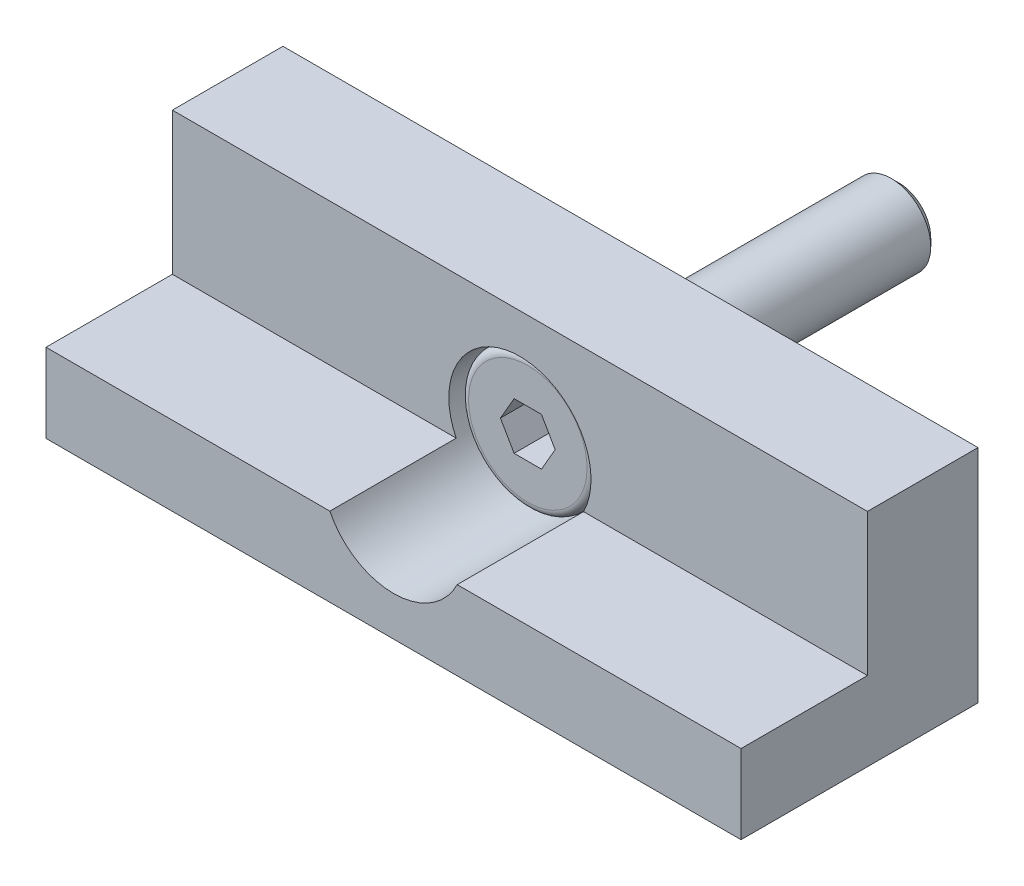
ISO-10303-21;
HEADER;
FILE_DESCRIPTION(('STEP AP214'),'2;1');
FILE_NAME('part.step','',(''),(''),'','','');
FILE_SCHEMA(('AUTOMOTIVE_DESIGN { 1 0 10303 214 1 1 1 1 }'));
ENDSEC;
DATA;
#1=APPLICATION_CONTEXT('core data for automotive mechanical design processes');
#2=APPLICATION_PROTOCOL_DEFINITION('international standard','automotive_design',2000,#1);
#3=PRODUCT_CONTEXT('',#1,'mechanical');
#4=PRODUCT('Part','Part','',(#3));
#5=PRODUCT_RELATED_PRODUCT_CATEGORY('part','',(#4));
#6=PRODUCT_DEFINITION_FORMATION('','',#4);
#7=PRODUCT_DEFINITION_CONTEXT('part definition',#1,'design');
#8=PRODUCT_DEFINITION('design','',#6,#7);
#9=PRODUCT_DEFINITION_SHAPE('','',#8);
#10=(LENGTH_UNIT() NAMED_UNIT(*) SI_UNIT(.MILLI.,.METRE.));
#11=(NAMED_UNIT(*) PLANE_ANGLE_UNIT() SI_UNIT($,.RADIAN.));
#12=(NAMED_UNIT(*) SI_UNIT($,.STERADIAN.) SOLID_ANGLE_UNIT());
#13=UNCERTAINTY_MEASURE_WITH_UNIT(LENGTH_MEASURE(1.E-05),#10,'distance_accuracy_value','');
#14=(GEOMETRIC_REPRESENTATION_CONTEXT(3) GLOBAL_UNCERTAINTY_ASSIGNED_CONTEXT((#13)) GLOBAL_UNIT_ASSIGNED_CONTEXT((#10,
#11,#12)) REPRESENTATION_CONTEXT('',''));
#15=CARTESIAN_POINT('',(0.,0.,0.));
#16=DIRECTION('',(0.,0.,1.));
#17=DIRECTION('',(1.,0.,0.));
#18=AXIS2_PLACEMENT_3D('',#15,#16,#17);
#19=CARTESIAN_POINT('',(0.,1.25,-17.));
#20=DIRECTION('',(0.,0.,-1.));
#21=DIRECTION('',(0.,1.,0.));
#22=AXIS2_PLACEMENT_3D('',#19,#20,#21);
#23=PLANE('',#22);
#24=CARTESIAN_POINT('',(0.,0.,-16.9999999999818));
#25=DIRECTION('',(0.,0.,1.));
#26=DIRECTION('',(1.,0.,0.));
#27=AXIS2_PLACEMENT_3D('',#24,#25,#26);
#28=CIRCLE('',#27,2.00924000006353);
#29=CARTESIAN_POINT('',(2.00924000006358,0.,-16.9999999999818));
#30=VERTEX_POINT('',#29);
#31=EDGE_CURVE('E273',#30,#30,#28,.T.);
#32=ORIENTED_EDGE('',*,*,#31,.F.);
#33=EDGE_LOOP('',(#32));
#34=FACE_BOUND('',#33,.T.);
#35=ADVANCED_FACE('F14',(#34),#23,.T.);
#36=CARTESIAN_POINT('',(0.,0.,-16.5092399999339));
#37=DIRECTION('',(0.,0.,1.));
#38=DIRECTION('',(1.,0.,0.));
#39=AXIS2_PLACEMENT_3D('',#36,#37,#38);
#40=CONICAL_SURFACE('',#39,2.50000000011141,0.785398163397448);
#41=ORIENTED_EDGE('',*,*,#31,.T.);
#42=EDGE_LOOP('',(#41));
#43=FACE_BOUND('',#42,.T.);
#44=CARTESIAN_POINT('',(0.,0.,-16.50924));
#45=DIRECTION('',(0.,0.,-1.));
#46=DIRECTION('',(0.,1.,0.));
#47=AXIS2_PLACEMENT_3D('',#44,#45,#46);
#48=CIRCLE('',#47,2.5);
#49=CARTESIAN_POINT('',(0.,2.5,-16.50924));
#50=VERTEX_POINT('',#49);
#51=EDGE_CURVE('E152',#50,#50,#48,.F.);
#52=ORIENTED_EDGE('',*,*,#51,.F.);
#53=EDGE_LOOP('',(#52));
#54=FACE_BOUND('',#53,.T.);
#55=ADVANCED_FACE('F175',(#43,#54),#40,.T.);
#56=CARTESIAN_POINT('',(0.,0.,-8.2));
#57=DIRECTION('',(0.,0.,-1.));
#58=DIRECTION('',(0.,1.,0.));
#59=AXIS2_PLACEMENT_3D('',#56,#57,#58);
#60=CYLINDRICAL_SURFACE('',#59,2.5);
#61=CARTESIAN_POINT('',(0.,0.,2.9));
#62=DIRECTION('',(0.,0.,-1.));
#63=DIRECTION('',(0.,1.,0.));
#64=AXIS2_PLACEMENT_3D('',#61,#62,#63);
#65=CIRCLE('',#64,2.5);
#66=CARTESIAN_POINT('',(0.,2.5,2.9));
#67=VERTEX_POINT('',#66);
#68=EDGE_CURVE('E22',#67,#67,#65,.T.);
#69=ORIENTED_EDGE('',*,*,#68,.T.);
#70=EDGE_LOOP('',(#69));
#71=FACE_BOUND('',#70,.T.);
#72=ORIENTED_EDGE('',*,*,#51,.T.);
#73=EDGE_LOOP('',(#72));
#74=FACE_BOUND('',#73,.T.);
#75=ADVANCED_FACE('F171',(#71,#74),#60,.T.);
#76=CARTESIAN_POINT('',(0.,0.,2.9));
#77=DIRECTION('',(0.,0.,-1.));
#78=DIRECTION('',(-1.,0.,0.));
#79=AXIS2_PLACEMENT_3D('',#76,#77,#78);
#80=TOROIDAL_SURFACE('',#79,2.6,0.1);
#81=ORIENTED_EDGE('',*,*,#68,.F.);
#82=EDGE_LOOP('',(#81));
#83=FACE_BOUND('',#82,.T.);
#84=CARTESIAN_POINT('',(0.,0.,3.));
#85=DIRECTION('',(0.,0.,-1.));
#86=DIRECTION('',(0.703656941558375,-0.710539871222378,0.));
#87=AXIS2_PLACEMENT_3D('',#84,#85,#86);
#88=CIRCLE('',#87,2.6);
#89=CARTESIAN_POINT('',(1.82950804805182,-1.84740366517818,3.));
#90=VERTEX_POINT('',#89);
#91=EDGE_CURVE('E157',#90,#90,#88,.F.);
#92=ORIENTED_EDGE('',*,*,#91,.F.);
#93=EDGE_LOOP('',(#92));
#94=FACE_BOUND('',#93,.T.);
#95=ADVANCED_FACE('F165',(#83,#94),#80,.F.);
#96=CARTESIAN_POINT('',(0.86602540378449,-1.5,6.5));
#97=DIRECTION('',(0.866025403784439,-0.5,0.));
#98=DIRECTION('',(-0.5,-0.866025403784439,0.));
#99=AXIS2_PLACEMENT_3D('',#96,#97,#98);
#100=PLANE('',#99);
#101=DIRECTION('',(0.,0.,-1.));
#102=VECTOR('',#101,1.);
#103=CARTESIAN_POINT('',(0.86602540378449,-1.5,6.5));
#104=LINE('',#103,#102);
#105=CARTESIAN_POINT('',(0.866025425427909,-1.49999996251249,3.79999998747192));
#106=VERTEX_POINT('',#105);
#107=CARTESIAN_POINT('',(0.86602540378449,-1.5,6.5));
#108=VERTEX_POINT('',#107);
#109=EDGE_CURVE('E256',#106,#108,#104,.F.);
#110=ORIENTED_EDGE('',*,*,#109,.T.);
#111=DIRECTION('',(-0.5,-0.866025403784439,0.));
#112=VECTOR('',#111,1.);
#113=CARTESIAN_POINT('',(0.86602540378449,-1.5,6.5));
#114=LINE('',#113,#112);
#115=CARTESIAN_POINT('',(1.73205080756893,0.,6.5));
#116=VERTEX_POINT('',#115);
#117=EDGE_CURVE('E260',#116,#108,#114,.T.);
#118=ORIENTED_EDGE('',*,*,#117,.F.);
#119=DIRECTION('',(0.,0.,-1.));
#120=VECTOR('',#119,1.);
#121=CARTESIAN_POINT('',(1.73205080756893,0.,6.5));
#122=LINE('',#121,#120);
#123=CARTESIAN_POINT('',(1.73205080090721,1.15384347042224E-08,3.79999999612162));
#124=VERTEX_POINT('',#123);
#125=EDGE_CURVE('E246',#116,#124,#122,.T.);
#126=ORIENTED_EDGE('',*,*,#125,.T.);
#127=CARTESIAN_POINT('',(1.73205079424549,-2.30768650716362E-08,3.79999999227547));
#128=CARTESIAN_POINT('',(1.69399422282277,-0.0659159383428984,3.77802165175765));
#129=CARTESIAN_POINT('',(1.65560914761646,-0.132400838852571,3.75803350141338));
#130=CARTESIAN_POINT('',(1.57817438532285,-0.266521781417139,3.72314478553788));
#131=CARTESIAN_POINT('',(1.53912332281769,-0.334160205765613,3.70825656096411));
#132=CARTESIAN_POINT('',(1.46150513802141,-0.468598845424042,3.68508196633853));
#133=CARTESIAN_POINT('',(1.42294995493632,-0.535378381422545,3.67664133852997));
#134=CARTESIAN_POINT('',(1.34565826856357,-0.669251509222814,3.66656687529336));
#135=CARTESIAN_POINT('',(1.30692204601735,-0.736344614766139,3.66492469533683));
#136=CARTESIAN_POINT('',(1.23454757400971,-0.861700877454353,3.66834971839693));
#137=CARTESIAN_POINT('',(1.20089846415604,-0.919982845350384,3.67257596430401));
#138=CARTESIAN_POINT('',(1.13381945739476,-1.03616709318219,3.68596797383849));
#139=CARTESIAN_POINT('',(1.10038979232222,-1.09406897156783,3.69513830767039));
#140=CARTESIAN_POINT('',(1.03317259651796,-1.21049256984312,3.71806236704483));
#141=CARTESIAN_POINT('',(0.999393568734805,-1.26899956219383,3.73191322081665));
#142=CARTESIAN_POINT('',(0.9323391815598,-1.38514116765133,3.76334880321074));
#143=CARTESIAN_POINT('',(0.899062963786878,-1.44277726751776,3.78092615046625));
#144=CARTESIAN_POINT('',(0.866025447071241,-1.49999992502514,3.79999997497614));
#145=B_SPLINE_CURVE_WITH_KNOTS('',3,(#127,#128,#129,#130,#131,#132,#133,#134,#135,#136,#137,
#138,#139,#140,#141,#142,#143,#144),.UNSPECIFIED.,.F.,.F.,(4,2,2,2,2,2,2,2,4),(0.,
0.237762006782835,0.476095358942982,0.708530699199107,0.940680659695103,1.14278080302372,
1.34506808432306,1.5518411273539,1.75820836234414),.UNSPECIFIED.);
#146=EDGE_CURVE('E230',#124,#106,#145,.T.);
#147=ORIENTED_EDGE('',*,*,#146,.T.);
#148=EDGE_LOOP('',(#110,#118,#126,#147));
#149=FACE_BOUND('',#148,.T.);
#150=ADVANCED_FACE('F170',(#149),#100,.F.);
#151=CARTESIAN_POINT('',(-0.866025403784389,-1.5,6.5));
#152=DIRECTION('',(0.,-1.,0.));
#153=DIRECTION('',(-1.,0.,0.));
#154=AXIS2_PLACEMENT_3D('',#151,#152,#153);
#155=PLANE('',#154);
#156=DIRECTION('',(0.,0.,-1.));
#157=VECTOR('',#156,1.);
#158=CARTESIAN_POINT('',(-0.866025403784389,-1.5,6.5));
#159=LINE('',#158,#157);
#160=CARTESIAN_POINT('',(-0.86602536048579,-1.5,3.79999998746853));
#161=VERTEX_POINT('',#160);
#162=CARTESIAN_POINT('',(-0.866025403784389,-1.5,6.5));
#163=VERTEX_POINT('',#162);
#164=EDGE_CURVE('E243',#161,#163,#159,.F.);
#165=ORIENTED_EDGE('',*,*,#164,.T.);
#166=DIRECTION('',(-1.,0.,0.));
#167=VECTOR('',#166,1.);
#168=CARTESIAN_POINT('',(-0.866025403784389,-1.5,6.5));
#169=LINE('',#168,#167);
#170=EDGE_CURVE('E259',#108,#163,#169,.T.);
#171=ORIENTED_EDGE('',*,*,#170,.F.);
#172=ORIENTED_EDGE('',*,*,#109,.F.);
#173=CARTESIAN_POINT('',(0.866025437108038,-1.5,3.80000000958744));
#174=CARTESIAN_POINT('',(0.789912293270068,-1.5,3.77802166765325));
#175=CARTESIAN_POINT('',(0.713142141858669,-1.5,3.75803351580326));
#176=CARTESIAN_POINT('',(0.558272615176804,-1.5,3.72314479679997));
#177=CARTESIAN_POINT('',(0.480170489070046,-1.5,3.70825657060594));
#178=CARTESIAN_POINT('',(0.324934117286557,-1.5,3.68508197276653));
#179=CARTESIAN_POINT('',(0.24782375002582,-1.5,3.67664134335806));
#180=CARTESIAN_POINT('',(0.0932403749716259,-1.5,3.66656687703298));
#181=CARTESIAN_POINT('',(0.0157679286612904,-1.5,3.66492469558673));
#182=CARTESIAN_POINT('',(-0.128981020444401,-1.5,3.66834971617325));
#183=CARTESIAN_POINT('',(-0.196279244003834,-1.5,3.67257596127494));
#184=CARTESIAN_POINT('',(-0.330437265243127,-1.5,3.68596796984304));
#185=CARTESIAN_POINT('',(-0.397296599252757,-1.5,3.69513830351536));
#186=CARTESIAN_POINT('',(-0.531730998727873,-1.5,3.71806236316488));
#187=CARTESIAN_POINT('',(-0.599289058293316,-1.5,3.73191321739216));
#188=CARTESIAN_POINT('',(-0.733397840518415,-1.5,3.7633488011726));
#189=CARTESIAN_POINT('',(-0.799950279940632,-1.5,3.7809261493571));
#190=CARTESIAN_POINT('',(-0.866025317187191,-1.5,3.7999999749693));
#191=B_SPLINE_CURVE_WITH_KNOTS('',3,(#173,#174,#175,#176,#177,#178,#179,#180,#181,#182,#183,
#184,#185,#186,#187,#188,#189,#190),.UNSPECIFIED.,.F.,.F.,(4,2,2,2,2,2,2,2,4),(0.,
0.237762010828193,0.476095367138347,0.708530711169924,0.940680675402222,1.14278083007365,
1.3450681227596,1.55184117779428,1.75820842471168),.UNSPECIFIED.);
#192=EDGE_CURVE('E304',#106,#161,#191,.T.);
#193=ORIENTED_EDGE('',*,*,#192,.T.);
#194=EDGE_LOOP('',(#165,#171,#172,#193));
#195=FACE_BOUND('',#194,.T.);
#196=ADVANCED_FACE('F332',(#195),#155,.F.);
#197=CARTESIAN_POINT('',(1.73205080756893,0.,6.5));
#198=DIRECTION('',(0.866025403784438,0.5,0.));
#199=DIRECTION('',(0.5,-0.866025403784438,0.));
#200=AXIS2_PLACEMENT_3D('',#197,#198,#199);
#201=PLANE('',#200);
#202=ORIENTED_EDGE('',*,*,#125,.F.);
#203=DIRECTION('',(0.5,-0.866025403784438,0.));
#204=VECTOR('',#203,1.);
#205=CARTESIAN_POINT('',(1.73205080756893,0.,6.5));
#206=LINE('',#205,#204);
#207=CARTESIAN_POINT('',(0.86602540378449,1.5,6.5));
#208=VERTEX_POINT('',#207);
#209=EDGE_CURVE('E253',#208,#116,#206,.T.);
#210=ORIENTED_EDGE('',*,*,#209,.F.);
#211=DIRECTION('',(0.,0.,-1.));
#212=VECTOR('',#211,1.);
#213=CARTESIAN_POINT('',(0.86602540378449,1.5,6.5));
#214=LINE('',#213,#212);
#215=CARTESIAN_POINT('',(0.866025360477,1.5,3.79999998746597));
#216=VERTEX_POINT('',#215);
#217=EDGE_CURVE('E228',#208,#216,#214,.T.);
#218=ORIENTED_EDGE('',*,*,#217,.T.);
#219=CARTESIAN_POINT('',(0.866025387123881,1.50000002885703,3.80000000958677));
#220=CARTESIAN_POINT('',(0.904081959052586,1.43408411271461,3.77802166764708));
#221=CARTESIAN_POINT('',(0.942467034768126,1.36759921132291,3.75803351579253));
#222=CARTESIAN_POINT('',(1.01990179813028,1.23347826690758,3.72314479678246));
#223=CARTESIAN_POINT('',(1.05895286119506,1.16583984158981,3.70825657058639));
#224=CARTESIAN_POINT('',(1.13657104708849,1.03140120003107,3.68508197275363));
#225=CARTESIAN_POINT('',(1.17512623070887,0.964621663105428,3.67664134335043));
#226=CARTESIAN_POINT('',(1.25241791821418,0.83074853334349,3.66656687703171));
#227=CARTESIAN_POINT('',(1.29115414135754,0.763655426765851,3.66492469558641));
#228=CARTESIAN_POINT('',(1.36352861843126,0.638299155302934,3.66834971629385));
#229=CARTESIAN_POINT('',(1.39717773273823,0.580017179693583,3.67257596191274));
#230=CARTESIAN_POINT('',(1.46425674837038,0.463832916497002,3.68596797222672));
#231=CARTESIAN_POINT('',(1.49768641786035,0.405931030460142,3.6951383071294));
#232=CARTESIAN_POINT('',(1.56490362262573,0.289507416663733,3.71806236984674));
#233=CARTESIAN_POINT('',(1.59868265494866,0.231000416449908,3.73191322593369));
#234=CARTESIAN_POINT('',(1.6657370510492,0.114858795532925,3.76334881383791));
#235=CARTESIAN_POINT('',(1.69901327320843,0.0572226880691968,3.78092616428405));
#236=CARTESIAN_POINT('',(1.73205079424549,2.30768698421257E-08,3.79999999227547));
#237=B_SPLINE_CURVE_WITH_KNOTS('',3,(#219,#220,#221,#222,#223,#224,#225,#226,#227,#228,#229,
#230,#231,#232,#233,#234,#235,#236),.UNSPECIFIED.,.F.,.F.,(4,2,2,2,2,2,2,2,4),(0.,
0.237762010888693,0.476095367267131,0.708530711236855,0.940680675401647,1.14278084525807,
1.3450681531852,1.55184122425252,1.75820848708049),.UNSPECIFIED.);
#238=EDGE_CURVE('E225',#216,#124,#237,.T.);
#239=ORIENTED_EDGE('',*,*,#238,.T.);
#240=EDGE_LOOP('',(#202,#210,#218,#239));
#241=FACE_BOUND('',#240,.T.);
#242=ADVANCED_FACE('F328',(#241),#201,.F.);
#243=CARTESIAN_POINT('',(-1.73205080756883,0.,6.5));
#244=DIRECTION('',(-0.866025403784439,-0.5,0.));
#245=DIRECTION('',(-0.5,0.866025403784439,0.));
#246=AXIS2_PLACEMENT_3D('',#243,#244,#245);
#247=PLANE('',#246);
#248=DIRECTION('',(0.,0.,-1.));
#249=VECTOR('',#248,1.);
#250=CARTESIAN_POINT('',(-1.73205080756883,0.,6.5));
#251=LINE('',#250,#249);
#252=CARTESIAN_POINT('',(-1.73205079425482,-5.19199600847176E-08,3.79999999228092));
#253=VERTEX_POINT('',#252);
#254=CARTESIAN_POINT('',(-1.73205080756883,0.,6.5));
#255=VERTEX_POINT('',#254);
#256=EDGE_CURVE('E220',#253,#255,#251,.F.);
#257=ORIENTED_EDGE('',*,*,#256,.T.);
#258=DIRECTION('',(-0.5,0.866025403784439,0.));
#259=VECTOR('',#258,1.);
#260=CARTESIAN_POINT('',(-1.73205080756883,0.,6.5));
#261=LINE('',#260,#259);
#262=EDGE_CURVE('E235',#163,#255,#261,.T.);
#263=ORIENTED_EDGE('',*,*,#262,.F.);
#264=ORIENTED_EDGE('',*,*,#164,.F.);
#265=CARTESIAN_POINT('',(-0.866025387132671,-1.50000002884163,3.80000000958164));
#266=CARTESIAN_POINT('',(-0.904081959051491,-1.43408411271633,3.77802166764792));
#267=CARTESIAN_POINT('',(-0.942467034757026,-1.36759921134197,3.75803351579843));
#268=CARTESIAN_POINT('',(-1.01990179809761,-1.233478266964,3.72314479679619));
#269=CARTESIAN_POINT('',(-1.05895286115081,-1.16583984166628,3.7082565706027));
#270=CARTESIAN_POINT('',(-1.13657104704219,-1.03140120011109,3.68508197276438));
#271=CARTESIAN_POINT('',(-1.17512623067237,-0.964621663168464,3.67664134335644));
#272=CARTESIAN_POINT('',(-1.25241791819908,-0.830748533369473,3.6665668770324));
#273=CARTESIAN_POINT('',(-1.29115414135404,-0.763655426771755,3.66492469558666));
#274=CARTESIAN_POINT('',(-1.36352861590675,-0.63829915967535,3.66834971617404));
#275=CARTESIAN_POINT('',(-1.39717772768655,-0.580017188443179,3.67257596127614));
#276=CARTESIAN_POINT('',(-1.46425673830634,-0.463832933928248,3.68596796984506));
#277=CARTESIAN_POINT('',(-1.49768640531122,-0.405931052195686,3.69513830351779));
#278=CARTESIAN_POINT('',(-1.5649036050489,-0.289507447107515,3.7180623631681));
#279=CARTESIAN_POINT('',(-1.59868263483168,-0.231000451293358,3.73191321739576));
#280=CARTESIAN_POINT('',(-1.66573702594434,-0.114858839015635,3.76334880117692));
#281=CARTESIAN_POINT('',(-1.69901324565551,-0.0572227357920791,3.78092614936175));
#282=CARTESIAN_POINT('',(-1.73205076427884,-7.49804649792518E-08,3.79999997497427));
#283=B_SPLINE_CURVE_WITH_KNOTS('',3,(#265,#266,#267,#268,#269,#270,#271,#272,#273,#274,#275,
#276,#277,#278,#279,#280,#281,#282),.UNSPECIFIED.,.F.,.F.,(4,2,2,2,2,2,2,2,4),(0.,
0.237762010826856,0.476095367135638,0.708530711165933,0.940680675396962,1.14278083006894,
1.34506812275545,1.55184117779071,1.75820842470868),.UNSPECIFIED.);
#284=EDGE_CURVE('E320',#161,#253,#283,.T.);
#285=ORIENTED_EDGE('',*,*,#284,.T.);
#286=EDGE_LOOP('',(#257,#263,#264,#285));
#287=FACE_BOUND('',#286,.T.);
#288=ADVANCED_FACE('F325',(#287),#247,.F.);
#289=CARTESIAN_POINT('',(0.86602540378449,1.5,6.5));
#290=DIRECTION('',(0.,1.,0.));
#291=DIRECTION('',(1.,0.,0.));
#292=AXIS2_PLACEMENT_3D('',#289,#290,#291);
#293=PLANE('',#292);
#294=ORIENTED_EDGE('',*,*,#217,.F.);
#295=DIRECTION('',(1.,0.,0.));
#296=VECTOR('',#295,1.);
#297=CARTESIAN_POINT('',(0.86602540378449,1.5,6.5));
#298=LINE('',#297,#296);
#299=CARTESIAN_POINT('',(-0.866025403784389,1.5,6.5));
#300=VERTEX_POINT('',#299);
#301=EDGE_CURVE('E231',#300,#208,#298,.T.);
#302=ORIENTED_EDGE('',*,*,#301,.F.);
#303=DIRECTION('',(0.,0.,-1.));
#304=VECTOR('',#303,1.);
#305=CARTESIAN_POINT('',(-0.866025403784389,1.5,6.5));
#306=LINE('',#305,#304);
#307=CARTESIAN_POINT('',(-0.86602540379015,1.5,3.79999999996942));
#308=VERTEX_POINT('',#307);
#309=EDGE_CURVE('E212',#300,#308,#306,.T.);
#310=ORIENTED_EDGE('',*,*,#309,.T.);
#311=CARTESIAN_POINT('',(-0.86602540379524,1.49999999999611,3.79999999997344));
#312=CARTESIAN_POINT('',(-0.789912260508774,1.4999999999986,3.77802165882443));
#313=CARTESIAN_POINT('',(-0.713142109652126,1.49999999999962,3.75803350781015));
#314=CARTESIAN_POINT('',(-0.558272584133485,1.50000000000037,3.72314479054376));
#315=CARTESIAN_POINT('',(-0.480170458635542,1.5000000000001,3.7082565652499));
#316=CARTESIAN_POINT('',(-0.32493408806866,1.4999999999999,3.68508196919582));
#317=CARTESIAN_POINT('',(-0.247823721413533,1.49999999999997,3.67664134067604));
#318=CARTESIAN_POINT('',(-0.0932403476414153,1.50000000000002,3.66656687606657));
#319=CARTESIAN_POINT('',(-0.0157679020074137,1.50000000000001,3.6649246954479));
#320=CARTESIAN_POINT('',(0.12898104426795,1.49999999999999,3.6683497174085));
#321=CARTESIAN_POINT('',(0.196279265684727,1.5,3.67257596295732));
#322=CARTESIAN_POINT('',(0.330437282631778,1.5,3.68596797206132));
#323=CARTESIAN_POINT('',(0.397296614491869,1.5,3.69513830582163));
#324=CARTESIAN_POINT('',(0.531731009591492,1.5,3.71806236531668));
#325=CARTESIAN_POINT('',(0.5992890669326,1.5,3.73191321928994));
#326=CARTESIAN_POINT('',(0.733397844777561,1.5,3.76334880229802));
#327=CARTESIAN_POINT('',(0.799950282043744,1.5,3.78092614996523));
#328=CARTESIAN_POINT('',(0.866025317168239,1.5,3.7999999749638));
#329=B_SPLINE_CURVE_WITH_KNOTS('',3,(#311,#312,#313,#314,#315,#316,#317,#318,#319,#320,#321,
#322,#323,#324,#325,#326,#327,#328),.UNSPECIFIED.,.F.,.F.,(4,2,2,2,2,2,2,2,4),(0.,
0.237762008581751,0.476095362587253,0.708530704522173,0.940680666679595,1.14278081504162,
1.3450681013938,1.55184114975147,1.75820839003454),.UNSPECIFIED.);
#330=EDGE_CURVE('E315',#308,#216,#329,.T.);
#331=ORIENTED_EDGE('',*,*,#330,.T.);
#332=EDGE_LOOP('',(#294,#302,#310,#331));
#333=FACE_BOUND('',#332,.T.);
#334=ADVANCED_FACE('F297',(#333),#293,.F.);
#335=CARTESIAN_POINT('',(0.,0.,3.80599999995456));
#336=DIRECTION('',(0.,0.,1.));
#337=DIRECTION('',(1.,0.,0.));
#338=AXIS2_PLACEMENT_3D('',#335,#336,#337);
#339=CONICAL_SURFACE('',#338,1.74244311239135,1.04719755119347);
#340=CARTESIAN_POINT('',(0.,5.6845153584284E-11,2.79999999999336));
#341=VERTEX_POINT('',#340);
#342=VERTEX_LOOP('',#341);
#343=FACE_BOUND('',#342,.T.);
#344=ORIENTED_EDGE('',*,*,#330,.F.);
#345=CARTESIAN_POINT('',(-0.866025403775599,1.50000000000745,3.79999999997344));
#346=CARTESIAN_POINT('',(-0.904081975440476,1.43408408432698,3.77802165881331));
#347=CARTESIAN_POINT('',(-0.942467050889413,1.3675991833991,3.7580335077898));
#348=CARTESIAN_POINT('',(-1.01990181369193,1.2334782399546,3.7231447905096));
#349=CARTESIAN_POINT('',(-1.05895287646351,1.1658398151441,3.70825656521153));
#350=CARTESIAN_POINT('',(-1.13657106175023,1.03140117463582,3.6850819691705));
#351=CARTESIAN_POINT('',(-1.17512624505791,0.964621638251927,3.67664134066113));
#352=CARTESIAN_POINT('',(-1.25241793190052,0.830748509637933,3.66656687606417));
#353=CARTESIAN_POINT('',(-1.29115415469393,0.763655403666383,3.66492469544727));
#354=CARTESIAN_POINT('',(-1.36352863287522,0.638299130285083,3.6683497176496));
#355=CARTESIAN_POINT('',(-1.39717774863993,0.580017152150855,3.6725759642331));
#356=CARTESIAN_POINT('',(-1.46425676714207,0.463832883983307,3.68596797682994));
#357=CARTESIAN_POINT('',(-1.49768643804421,0.40593099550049,3.69513831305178));
#358=CARTESIAN_POINT('',(-1.5649036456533,0.289507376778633,3.71806237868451));
#359=CARTESIAN_POINT('',(-1.5986826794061,0.231000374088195,3.73191323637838));
#360=CARTESIAN_POINT('',(-1.66573707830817,0.114858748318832,3.76334882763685));
#361=CARTESIAN_POINT('',(-1.69901330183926,0.0572226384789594,3.78092617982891));
#362=CARTESIAN_POINT('',(-1.73205082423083,-2.88594248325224E-08,3.80000000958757));
#363=B_SPLINE_CURVE_WITH_KNOTS('',3,(#345,#346,#347,#348,#349,#350,#351,#352,#353,#354,#355,
#356,#357,#358,#359,#360,#361,#362),.UNSPECIFIED.,.F.,.F.,(4,2,2,2,2,2,2,2,4),(0.,
0.237762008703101,0.476095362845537,0.708530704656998,0.940680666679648,1.14278084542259,
1.34506816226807,1.55184124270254,1.7582085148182),.UNSPECIFIED.);
#364=EDGE_CURVE('E219',#308,#253,#363,.T.);
#365=ORIENTED_EDGE('',*,*,#364,.T.);
#366=ORIENTED_EDGE('',*,*,#284,.F.);
#367=ORIENTED_EDGE('',*,*,#192,.F.);
#368=ORIENTED_EDGE('',*,*,#146,.F.);
#369=ORIENTED_EDGE('',*,*,#238,.F.);
#370=EDGE_LOOP('',(#344,#365,#366,#367,#368,#369));
#371=FACE_BOUND('',#370,.T.);
#372=ADVANCED_FACE('F293',(#343,#371),#339,.F.);
#373=CARTESIAN_POINT('',(-0.866025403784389,1.5,6.5));
#374=DIRECTION('',(-0.866025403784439,0.5,0.));
#375=DIRECTION('',(0.5,0.866025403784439,0.));
#376=AXIS2_PLACEMENT_3D('',#373,#374,#375);
#377=PLANE('',#376);
#378=ORIENTED_EDGE('',*,*,#309,.F.);
#379=DIRECTION('',(0.5,0.866025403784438,0.));
#380=VECTOR('',#379,1.);
#381=CARTESIAN_POINT('',(-1.73205080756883,0.,6.5));
#382=LINE('',#381,#380);
#383=EDGE_CURVE('E238',#255,#300,#382,.T.);
#384=ORIENTED_EDGE('',*,*,#383,.F.);
#385=ORIENTED_EDGE('',*,*,#256,.F.);
#386=ORIENTED_EDGE('',*,*,#364,.F.);
#387=EDGE_LOOP('',(#378,#384,#385,#386));
#388=FACE_BOUND('',#387,.T.);
#389=ADVANCED_FACE('F291',(#388),#377,.F.);
#390=CARTESIAN_POINT('',(0.,2.99102540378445,6.5));
#391=DIRECTION('',(0.,0.,1.));
#392=DIRECTION('',(0.,-1.,0.));
#393=AXIS2_PLACEMENT_3D('',#390,#391,#392);
#394=PLANE('',#393);
#395=ORIENTED_EDGE('',*,*,#262,.T.);
#396=ORIENTED_EDGE('',*,*,#383,.T.);
#397=ORIENTED_EDGE('',*,*,#301,.T.);
#398=ORIENTED_EDGE('',*,*,#209,.T.);
#399=ORIENTED_EDGE('',*,*,#117,.T.);
#400=ORIENTED_EDGE('',*,*,#170,.T.);
#401=EDGE_LOOP('',(#395,#396,#397,#398,#399,#400));
#402=FACE_BOUND('',#401,.T.);
#403=CARTESIAN_POINT('',(0.,0.,6.5));
#404=DIRECTION('',(0.,0.,-1.));
#405=DIRECTION('',(0.,1.,0.));
#406=AXIS2_PLACEMENT_3D('',#403,#404,#405);
#407=CIRCLE('',#406,3.75);
#408=CARTESIAN_POINT('',(0.,3.75,6.5));
#409=VERTEX_POINT('',#408);
#410=EDGE_CURVE('E189',#409,#409,#407,.T.);
#411=ORIENTED_EDGE('',*,*,#410,.F.);
#412=EDGE_LOOP('',(#411));
#413=FACE_BOUND('',#412,.T.);
#414=ADVANCED_FACE('F202',(#402,#413),#394,.T.);
#415=CARTESIAN_POINT('',(0.,0.,6.));
#416=DIRECTION('',(0.,0.,-1.));
#417=DIRECTION('',(-1.,0.,0.));
#418=AXIS2_PLACEMENT_3D('',#415,#416,#417);
#419=TOROIDAL_SURFACE('',#418,3.75,0.5);
#420=CARTESIAN_POINT('',(0.,0.,6.));
#421=DIRECTION('',(0.,0.,-1.));
#422=DIRECTION('',(0.,1.,0.));
#423=AXIS2_PLACEMENT_3D('',#420,#421,#422);
#424=CIRCLE('',#423,4.25);
#425=CARTESIAN_POINT('',(0.,4.25,6.));
#426=VERTEX_POINT('',#425);
#427=EDGE_CURVE('E180',#426,#426,#424,.T.);
#428=ORIENTED_EDGE('',*,*,#427,.F.);
#429=EDGE_LOOP('',(#428));
#430=FACE_BOUND('',#429,.T.);
#431=ORIENTED_EDGE('',*,*,#410,.T.);
#432=EDGE_LOOP('',(#431));
#433=FACE_BOUND('',#432,.T.);
#434=ADVANCED_FACE('F197',(#430,#433),#419,.T.);
#435=CARTESIAN_POINT('',(0.,0.,4.75));
#436=DIRECTION('',(0.,0.,-1.));
#437=DIRECTION('',(0.,1.,0.));
#438=AXIS2_PLACEMENT_3D('',#435,#436,#437);
#439=CYLINDRICAL_SURFACE('',#438,4.25);
#440=ORIENTED_EDGE('',*,*,#427,.T.);
#441=EDGE_LOOP('',(#440));
#442=FACE_BOUND('',#441,.T.);
#443=CARTESIAN_POINT('',(0.,0.,3.));
#444=DIRECTION('',(0.,0.,-1.));
#445=DIRECTION('',(0.,1.,0.));
#446=AXIS2_PLACEMENT_3D('',#443,#444,#445);
#447=CIRCLE('',#446,4.25);
#448=CARTESIAN_POINT('',(0.,4.25,3.));
#449=VERTEX_POINT('',#448);
#450=EDGE_CURVE('E188',#449,#449,#447,.T.);
#451=ORIENTED_EDGE('',*,*,#450,.F.);
#452=EDGE_LOOP('',(#451));
#453=FACE_BOUND('',#452,.T.);
#454=ADVANCED_FACE('F173',(#442,#453),#439,.T.);
#455=CARTESIAN_POINT('',(0.,3.5,7.));
#456=DIRECTION('',(0.,0.,-1.));
#457=DIRECTION('',(1.,0.,0.));
#458=AXIS2_PLACEMENT_3D('',#455,#456,#457);
#459=PLANE('',#458);
#460=CARTESIAN_POINT('',(0.,0.,7.));
#461=DIRECTION('',(0.,0.,1.));
#462=DIRECTION('',(-1.,0.,0.));
#463=AXIS2_PLACEMENT_3D('',#460,#461,#462);
#464=CIRCLE('',#463,4.5);
#465=CARTESIAN_POINT('',(4.03112887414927,-2.,7.));
#466=VERTEX_POINT('',#465);
#467=CARTESIAN_POINT('',(-4.03112887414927,-2.,7.));
#468=VERTEX_POINT('',#467);
#469=EDGE_CURVE('E135',#466,#468,#464,.T.);
#470=ORIENTED_EDGE('',*,*,#469,.F.);
#471=DIRECTION('',(1.,0.,0.));
#472=VECTOR('',#471,1.);
#473=CARTESIAN_POINT('',(-22.0001030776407,-2.,7.));
#474=LINE('',#473,#472);
#475=CARTESIAN_POINT('',(22.,-2.,7.));
#476=VERTEX_POINT('',#475);
#477=EDGE_CURVE('E133',#466,#476,#474,.T.);
#478=ORIENTED_EDGE('',*,*,#477,.T.);
#479=DIRECTION('',(0.,-1.,0.));
#480=VECTOR('',#479,1.);
#481=CARTESIAN_POINT('',(22.,7.,7.));
#482=LINE('',#481,#480);
#483=CARTESIAN_POINT('',(22.,7.,7.));
#484=VERTEX_POINT('',#483);
#485=EDGE_CURVE('E121',#484,#476,#482,.T.);
#486=ORIENTED_EDGE('',*,*,#485,.F.);
#487=DIRECTION('',(1.,0.,0.));
#488=VECTOR('',#487,1.);
#489=CARTESIAN_POINT('',(0.,7.,7.));
#490=LINE('',#489,#488);
#491=CARTESIAN_POINT('',(-22.,7.,7.));
#492=VERTEX_POINT('',#491);
#493=EDGE_CURVE('E441',#492,#484,#490,.T.);
#494=ORIENTED_EDGE('',*,*,#493,.F.);
#495=DIRECTION('',(0.,-1.,0.));
#496=VECTOR('',#495,1.);
#497=CARTESIAN_POINT('',(-22.,7.,7.));
#498=LINE('',#497,#496);
#499=CARTESIAN_POINT('',(-22.,-2.,7.));
#500=VERTEX_POINT('',#499);
#501=EDGE_CURVE('E37',#492,#500,#498,.T.);
#502=ORIENTED_EDGE('',*,*,#501,.T.);
#503=EDGE_CURVE('E137',#500,#468,#474,.T.);
#504=ORIENTED_EDGE('',*,*,#503,.T.);
#505=EDGE_LOOP('',(#470,#478,#486,#494,#502,#504));
#506=FACE_BOUND('',#505,.T.);
#507=ADVANCED_FACE('F134',(#506),#459,.F.);
#508=CARTESIAN_POINT('',(22.,7.,15.));
#509=DIRECTION('',(0.,0.,1.));
#510=DIRECTION('',(-1.,0.,0.));
#511=AXIS2_PLACEMENT_3D('',#508,#509,#510);
#512=PLANE('',#511);
#513=DIRECTION('',(1.,0.,0.));
#514=VECTOR('',#513,1.);
#515=CARTESIAN_POINT('',(-22.0001030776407,-2.,15.));
#516=LINE('',#515,#514);
#517=CARTESIAN_POINT('',(-22.,-2.,15.));
#518=VERTEX_POINT('',#517);
#519=CARTESIAN_POINT('',(-4.03112887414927,-2.,15.));
#520=VERTEX_POINT('',#519);
#521=EDGE_CURVE('E138',#518,#520,#516,.T.);
#522=ORIENTED_EDGE('',*,*,#521,.F.);
#523=DIRECTION('',(0.,-1.,0.));
#524=VECTOR('',#523,1.);
#525=CARTESIAN_POINT('',(-22.,7.,15.));
#526=LINE('',#525,#524);
#527=CARTESIAN_POINT('',(-22.,-7.,15.));
#528=VERTEX_POINT('',#527);
#529=EDGE_CURVE('E361',#518,#528,#526,.T.);
#530=ORIENTED_EDGE('',*,*,#529,.T.);
#531=DIRECTION('',(-1.,0.,0.));
#532=VECTOR('',#531,1.);
#533=CARTESIAN_POINT('',(11.,-7.,15.));
#534=LINE('',#533,#532);
#535=CARTESIAN_POINT('',(22.,-7.,15.));
#536=VERTEX_POINT('',#535);
#537=EDGE_CURVE('E352',#536,#528,#534,.T.);
#538=ORIENTED_EDGE('',*,*,#537,.F.);
#539=DIRECTION('',(0.,-1.,0.));
#540=VECTOR('',#539,1.);
#541=CARTESIAN_POINT('',(22.,7.,15.));
#542=LINE('',#541,#540);
#543=CARTESIAN_POINT('',(22.,-2.,15.));
#544=VERTEX_POINT('',#543);
#545=EDGE_CURVE('E365',#536,#544,#542,.F.);
#546=ORIENTED_EDGE('',*,*,#545,.T.);
#547=CARTESIAN_POINT('',(4.03112887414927,-2.,15.));
#548=VERTEX_POINT('',#547);
#549=EDGE_CURVE('E29',#548,#544,#516,.T.);
#550=ORIENTED_EDGE('',*,*,#549,.F.);
#551=CARTESIAN_POINT('',(0.,0.,15.));
#552=DIRECTION('',(0.,0.,1.));
#553=DIRECTION('',(-1.,0.,0.));
#554=AXIS2_PLACEMENT_3D('',#551,#552,#553);
#555=CIRCLE('',#554,4.5);
#556=EDGE_CURVE('E367',#548,#520,#555,.F.);
#557=ORIENTED_EDGE('',*,*,#556,.T.);
#558=EDGE_LOOP('',(#522,#530,#538,#546,#550,#557));
#559=FACE_BOUND('',#558,.T.);
#560=ADVANCED_FACE('F400',(#559),#512,.T.);
#561=CARTESIAN_POINT('',(0.,0.,9.));
#562=DIRECTION('',(0.,0.,1.));
#563=DIRECTION('',(-1.,0.,0.));
#564=AXIS2_PLACEMENT_3D('',#561,#562,#563);
#565=CYLINDRICAL_SURFACE('',#564,4.5);
#566=CARTESIAN_POINT('',(0.,0.,3.));
#567=DIRECTION('',(0.,0.,1.));
#568=DIRECTION('',(-1.,0.,0.));
#569=AXIS2_PLACEMENT_3D('',#566,#567,#568);
#570=CIRCLE('',#569,4.5);
#571=CARTESIAN_POINT('',(-4.5,0.,3.));
#572=VERTEX_POINT('',#571);
#573=EDGE_CURVE('E149',#572,#572,#570,.T.);
#574=ORIENTED_EDGE('',*,*,#573,.F.);
#575=EDGE_LOOP('',(#574));
#576=FACE_BOUND('',#575,.T.);
#577=DIRECTION('',(0.,0.,1.));
#578=VECTOR('',#577,1.);
#579=CARTESIAN_POINT('',(4.03112887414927,-2.,9.));
#580=LINE('',#579,#578);
#581=EDGE_CURVE('E147',#548,#466,#580,.F.);
#582=ORIENTED_EDGE('',*,*,#581,.T.);
#583=ORIENTED_EDGE('',*,*,#469,.T.);
#584=DIRECTION('',(0.,0.,1.));
#585=VECTOR('',#584,1.);
#586=CARTESIAN_POINT('',(-4.03112887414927,-2.,9.));
#587=LINE('',#586,#585);
#588=EDGE_CURVE('E144',#468,#520,#587,.T.);
#589=ORIENTED_EDGE('',*,*,#588,.T.);
#590=ORIENTED_EDGE('',*,*,#556,.F.);
#591=EDGE_LOOP('',(#582,#583,#589,#590));
#592=FACE_BOUND('',#591,.T.);
#593=ADVANCED_FACE('F397',(#576,#592),#565,.F.);
#594=CARTESIAN_POINT('',(0.,0.,3.));
#595=DIRECTION('',(0.,0.,1.));
#596=DIRECTION('',(-1.,0.,0.));
#597=AXIS2_PLACEMENT_3D('',#594,#595,#596);
#598=PLANE('',#597);
#599=ORIENTED_EDGE('',*,*,#450,.T.);
#600=EDGE_LOOP('',(#599));
#601=FACE_BOUND('',#600,.T.);
#602=ORIENTED_EDGE('',*,*,#573,.T.);
#603=EDGE_LOOP('',(#602));
#604=FACE_BOUND('',#603,.T.);
#605=ADVANCED_FACE('F16',(#601,#604),#598,.T.);
#606=CARTESIAN_POINT('',(22.,7.,0.));
#607=DIRECTION('',(1.,0.,0.));
#608=DIRECTION('',(0.,0.,1.));
#609=AXIS2_PLACEMENT_3D('',#606,#607,#608);
#610=PLANE('',#609);
#611=ORIENTED_EDGE('',*,*,#485,.T.);
#612=DIRECTION('',(0.,0.,-1.));
#613=VECTOR('',#612,1.);
#614=CARTESIAN_POINT('',(22.,-2.,15.));
#615=LINE('',#614,#613);
#616=EDGE_CURVE('E124',#544,#476,#615,.T.);
#617=ORIENTED_EDGE('',*,*,#616,.F.);
#618=ORIENTED_EDGE('',*,*,#545,.F.);
#619=DIRECTION('',(0.,0.,1.));
#620=VECTOR('',#619,1.);
#621=CARTESIAN_POINT('',(22.,-7.,7.5));
#622=LINE('',#621,#620);
#623=CARTESIAN_POINT('',(22.,-7.,0.));
#624=VERTEX_POINT('',#623);
#625=EDGE_CURVE('E356',#624,#536,#622,.T.);
#626=ORIENTED_EDGE('',*,*,#625,.F.);
#627=DIRECTION('',(0.,-1.,0.));
#628=VECTOR('',#627,1.);
#629=CARTESIAN_POINT('',(22.,7.,0.));
#630=LINE('',#629,#628);
#631=CARTESIAN_POINT('',(22.,7.,0.));
#632=VERTEX_POINT('',#631);
#633=EDGE_CURVE('E129',#624,#632,#630,.F.);
#634=ORIENTED_EDGE('',*,*,#633,.T.);
#635=DIRECTION('',(0.,0.,1.));
#636=VECTOR('',#635,1.);
#637=CARTESIAN_POINT('',(22.,7.,0.));
#638=LINE('',#637,#636);
#639=EDGE_CURVE('E128',#632,#484,#638,.T.);
#640=ORIENTED_EDGE('',*,*,#639,.T.);
#641=EDGE_LOOP('',(#611,#617,#618,#626,#634,#640));
#642=FACE_BOUND('',#641,.T.);
#643=ADVANCED_FACE('F123',(#642),#610,.T.);
#644=CARTESIAN_POINT('',(11.,7.,7.5));
#645=DIRECTION('',(0.,-1.,0.));
#646=DIRECTION('',(0.,0.,1.));
#647=AXIS2_PLACEMENT_3D('',#644,#645,#646);
#648=PLANE('',#647);
#649=ORIENTED_EDGE('',*,*,#639,.F.);
#650=DIRECTION('',(1.,0.,0.));
#651=VECTOR('',#650,1.);
#652=CARTESIAN_POINT('',(0.,7.,0.));
#653=LINE('',#652,#651);
#654=CARTESIAN_POINT('',(-22.,7.,0.));
#655=VERTEX_POINT('',#654);
#656=EDGE_CURVE('E363',#655,#632,#653,.T.);
#657=ORIENTED_EDGE('',*,*,#656,.F.);
#658=DIRECTION('',(0.,0.,1.));
#659=VECTOR('',#658,1.);
#660=CARTESIAN_POINT('',(-22.,7.,0.));
#661=LINE('',#660,#659);
#662=EDGE_CURVE('E360',#655,#492,#661,.T.);
#663=ORIENTED_EDGE('',*,*,#662,.T.);
#664=ORIENTED_EDGE('',*,*,#493,.T.);
#665=EDGE_LOOP('',(#649,#657,#663,#664));
#666=FACE_BOUND('',#665,.T.);
#667=ADVANCED_FACE('F402',(#666),#648,.F.);
#668=CARTESIAN_POINT('',(-22.,7.,0.));
#669=DIRECTION('',(1.,0.,0.));
#670=DIRECTION('',(0.,0.,1.));
#671=AXIS2_PLACEMENT_3D('',#668,#669,#670);
#672=PLANE('',#671);
#673=DIRECTION('',(0.,0.,-1.));
#674=VECTOR('',#673,1.);
#675=CARTESIAN_POINT('',(-22.,-2.,0.));
#676=LINE('',#675,#674);
#677=EDGE_CURVE('E9',#518,#500,#676,.T.);
#678=ORIENTED_EDGE('',*,*,#677,.T.);
#679=ORIENTED_EDGE('',*,*,#501,.F.);
#680=ORIENTED_EDGE('',*,*,#662,.F.);
#681=DIRECTION('',(0.,-1.,0.));
#682=VECTOR('',#681,1.);
#683=CARTESIAN_POINT('',(-22.,7.,0.));
#684=LINE('',#683,#682);
#685=CARTESIAN_POINT('',(-22.,-7.,0.));
#686=VERTEX_POINT('',#685);
#687=EDGE_CURVE('E357',#686,#655,#684,.F.);
#688=ORIENTED_EDGE('',*,*,#687,.F.);
#689=DIRECTION('',(0.,0.,1.));
#690=VECTOR('',#689,1.);
#691=CARTESIAN_POINT('',(-22.,-7.,7.5));
#692=LINE('',#691,#690);
#693=EDGE_CURVE('E270',#528,#686,#692,.F.);
#694=ORIENTED_EDGE('',*,*,#693,.F.);
#695=ORIENTED_EDGE('',*,*,#529,.F.);
#696=EDGE_LOOP('',(#678,#679,#680,#688,#694,#695));
#697=FACE_BOUND('',#696,.T.);
#698=ADVANCED_FACE('F405',(#697),#672,.F.);
#699=CARTESIAN_POINT('',(11.,-7.,7.5));
#700=DIRECTION('',(0.,-1.,0.));
#701=DIRECTION('',(0.,0.,1.));
#702=AXIS2_PLACEMENT_3D('',#699,#700,#701);
#703=PLANE('',#702);
#704=ORIENTED_EDGE('',*,*,#537,.T.);
#705=ORIENTED_EDGE('',*,*,#693,.T.);
#706=DIRECTION('',(-1.,0.,0.));
#707=VECTOR('',#706,1.);
#708=CARTESIAN_POINT('',(11.,-7.,0.));
#709=LINE('',#708,#707);
#710=EDGE_CURVE('E353',#686,#624,#709,.F.);
#711=ORIENTED_EDGE('',*,*,#710,.T.);
#712=ORIENTED_EDGE('',*,*,#625,.T.);
#713=EDGE_LOOP('',(#704,#705,#711,#712));
#714=FACE_BOUND('',#713,.T.);
#715=ADVANCED_FACE('F343',(#714),#703,.T.);
#716=CARTESIAN_POINT('',(0.,7.,0.));
#717=DIRECTION('',(0.,0.,-1.));
#718=DIRECTION('',(1.,0.,0.));
#719=AXIS2_PLACEMENT_3D('',#716,#717,#718);
#720=PLANE('',#719);
#721=CARTESIAN_POINT('',(0.,0.,0.));
#722=DIRECTION('',(0.,0.,1.));
#723=DIRECTION('',(-1.,0.,0.));
#724=AXIS2_PLACEMENT_3D('',#721,#722,#723);
#725=CIRCLE('',#724,2.6);
#726=CARTESIAN_POINT('',(-2.6,0.,0.));
#727=VERTEX_POINT('',#726);
#728=EDGE_CURVE('E130',#727,#727,#725,.T.);
#729=ORIENTED_EDGE('',*,*,#728,.T.);
#730=EDGE_LOOP('',(#729));
#731=FACE_BOUND('',#730,.T.);
#732=ORIENTED_EDGE('',*,*,#710,.F.);
#733=ORIENTED_EDGE('',*,*,#687,.T.);
#734=ORIENTED_EDGE('',*,*,#656,.T.);
#735=ORIENTED_EDGE('',*,*,#633,.F.);
#736=EDGE_LOOP('',(#732,#733,#734,#735));
#737=FACE_BOUND('',#736,.T.);
#738=ADVANCED_FACE('F395',(#731,#737),#720,.T.);
#739=CARTESIAN_POINT('',(0.,0.,-33.5489443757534));
#740=DIRECTION('',(0.,0.,1.));
#741=DIRECTION('',(-1.,0.,0.));
#742=AXIS2_PLACEMENT_3D('',#739,#740,#741);
#743=CYLINDRICAL_SURFACE('',#742,2.6);
#744=ORIENTED_EDGE('',*,*,#91,.T.);
#745=EDGE_LOOP('',(#744));
#746=FACE_BOUND('',#745,.T.);
#747=ORIENTED_EDGE('',*,*,#728,.F.);
#748=EDGE_LOOP('',(#747));
#749=FACE_BOUND('',#748,.T.);
#750=ADVANCED_FACE('F386',(#746,#749),#743,.F.);
#751=CARTESIAN_POINT('',(-22.0001030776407,-2.,15.));
#752=DIRECTION('',(0.,-1.,0.));
#753=DIRECTION('',(0.,0.,-1.));
#754=AXIS2_PLACEMENT_3D('',#751,#752,#753);
#755=PLANE('',#754);
#756=ORIENTED_EDGE('',*,*,#503,.F.);
#757=ORIENTED_EDGE('',*,*,#677,.F.);
#758=ORIENTED_EDGE('',*,*,#521,.T.);
#759=ORIENTED_EDGE('',*,*,#588,.F.);
#760=EDGE_LOOP('',(#756,#757,#758,#759));
#761=FACE_BOUND('',#760,.T.);
#762=ADVANCED_FACE('F342',(#761),#755,.F.);
#763=ORIENTED_EDGE('',*,*,#549,.T.);
#764=ORIENTED_EDGE('',*,*,#616,.T.);
#765=ORIENTED_EDGE('',*,*,#477,.F.);
#766=ORIENTED_EDGE('',*,*,#581,.F.);
#767=EDGE_LOOP('',(#763,#764,#765,#766));
#768=FACE_BOUND('',#767,.T.);
#769=ADVANCED_FACE('F140',(#768),#755,.F.);
#770=CLOSED_SHELL('',(#35,#55,#75,#95,#150,#196,#242,#288,#334,#372,#389,#414,#434,#454,#507,
#560,#593,#605,#643,#667,#698,#715,#738,#750,#762,#769));
#771=MANIFOLD_SOLID_BREP('B1',#770);
#772=ADVANCED_BREP_SHAPE_REPRESENTATION('',(#18,#771),#14);
#773=SHAPE_DEFINITION_REPRESENTATION(#9,#772);
ENDSEC;
END-ISO-10303-21;
